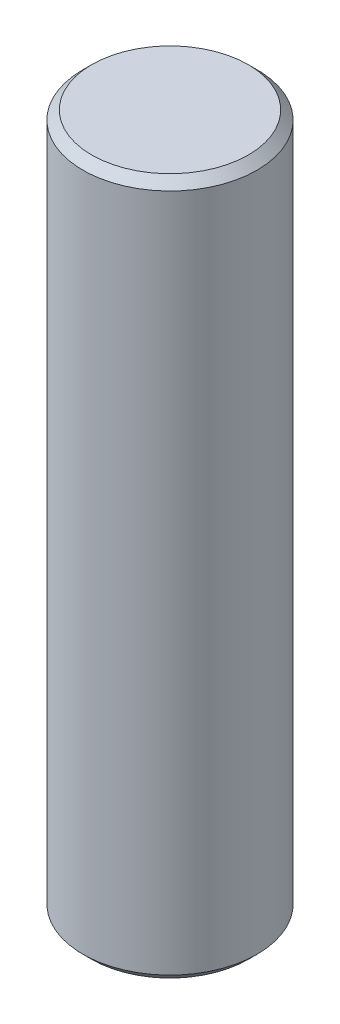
ISO-10303-21;
HEADER;
FILE_DESCRIPTION(('STEP AP214'),'2;1');
FILE_NAME('part.step','',(''),(''),'','','');
FILE_SCHEMA(('AUTOMOTIVE_DESIGN { 1 0 10303 214 1 1 1 1 }'));
ENDSEC;
DATA;
#1=APPLICATION_CONTEXT('core data for automotive mechanical design processes');
#2=APPLICATION_PROTOCOL_DEFINITION('international standard','automotive_design',2000,#1);
#3=PRODUCT_CONTEXT('',#1,'mechanical');
#4=PRODUCT('Part','Part','',(#3));
#5=PRODUCT_RELATED_PRODUCT_CATEGORY('part','',(#4));
#6=PRODUCT_DEFINITION_FORMATION('','',#4);
#7=PRODUCT_DEFINITION_CONTEXT('part definition',#1,'design');
#8=PRODUCT_DEFINITION('design','',#6,#7);
#9=PRODUCT_DEFINITION_SHAPE('','',#8);
#10=(LENGTH_UNIT() NAMED_UNIT(*) SI_UNIT(.MILLI.,.METRE.));
#11=(NAMED_UNIT(*) PLANE_ANGLE_UNIT() SI_UNIT($,.RADIAN.));
#12=(NAMED_UNIT(*) SI_UNIT($,.STERADIAN.) SOLID_ANGLE_UNIT());
#13=UNCERTAINTY_MEASURE_WITH_UNIT(LENGTH_MEASURE(1.E-05),#10,'distance_accuracy_value','');
#14=(GEOMETRIC_REPRESENTATION_CONTEXT(3) GLOBAL_UNCERTAINTY_ASSIGNED_CONTEXT((#13)) GLOBAL_UNIT_ASSIGNED_CONTEXT((#10,
#11,#12)) REPRESENTATION_CONTEXT('',''));
#15=CARTESIAN_POINT('',(0.,0.,0.));
#16=DIRECTION('',(0.,0.,1.));
#17=DIRECTION('',(1.,0.,0.));
#18=AXIS2_PLACEMENT_3D('',#15,#16,#17);
#19=CARTESIAN_POINT('',(0.,127.,0.));
#20=DIRECTION('',(0.,-1.,0.));
#21=DIRECTION('',(1.,0.,0.));
#22=AXIS2_PLACEMENT_3D('',#19,#20,#21);
#23=PLANE('',#22);
#24=CARTESIAN_POINT('',(0.,127.,0.));
#25=DIRECTION('',(0.,-1.,0.));
#26=DIRECTION('',(1.,0.,0.));
#27=AXIS2_PLACEMENT_3D('',#24,#25,#26);
#28=CIRCLE('',#27,14.2748);
#29=CARTESIAN_POINT('',(14.2748,127.,0.));
#30=VERTEX_POINT('',#29);
#31=EDGE_CURVE('E11',#30,#30,#28,.F.);
#32=ORIENTED_EDGE('',*,*,#31,.T.);
#33=EDGE_LOOP('',(#32));
#34=FACE_BOUND('',#33,.T.);
#35=ADVANCED_FACE('F36',(#34),#23,.F.);
#36=CARTESIAN_POINT('',(0.,127.,0.));
#37=DIRECTION('',(0.,1.,0.));
#38=DIRECTION('',(-1.,0.,0.));
#39=AXIS2_PLACEMENT_3D('',#36,#37,#38);
#40=CYLINDRICAL_SURFACE('',#39,15.875);
#41=CARTESIAN_POINT('',(0.,1.6002,0.));
#42=DIRECTION('',(0.,1.,0.));
#43=DIRECTION('',(-1.,0.,0.));
#44=AXIS2_PLACEMENT_3D('',#41,#42,#43);
#45=CIRCLE('',#44,15.875);
#46=CARTESIAN_POINT('',(-15.875,1.6002,0.));
#47=VERTEX_POINT('',#46);
#48=EDGE_CURVE('E59',#47,#47,#45,.T.);
#49=CARTESIAN_POINT('',(0.,125.3998,0.));
#50=DIRECTION('',(0.,-1.,0.));
#51=DIRECTION('',(1.,0.,0.));
#52=AXIS2_PLACEMENT_3D('',#49,#50,#51);
#53=CIRCLE('',#52,15.875);
#54=CARTESIAN_POINT('',(-15.875,125.3998,0.));
#55=VERTEX_POINT('',#54);
#56=EDGE_CURVE('E55',#55,#55,#53,.T.);
#57=CARTESIAN_POINT('',(-15.875,1.6002,0.));
#58=CARTESIAN_POINT('',(-15.875,2.88977916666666,0.));
#59=CARTESIAN_POINT('',(-15.875,4.17935833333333,0.));
#60=CARTESIAN_POINT('',(-15.875,6.75851666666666,0.));
#61=CARTESIAN_POINT('',(-15.875,8.04809583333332,0.));
#62=CARTESIAN_POINT('',(-15.875,10.6272541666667,0.));
#63=CARTESIAN_POINT('',(-15.875,11.9168333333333,0.));
#64=CARTESIAN_POINT('',(-15.875,14.4959916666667,0.));
#65=CARTESIAN_POINT('',(-15.875,15.7855708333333,0.));
#66=CARTESIAN_POINT('',(-15.875,18.3647291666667,0.));
#67=CARTESIAN_POINT('',(-15.875,19.6543083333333,0.));
#68=CARTESIAN_POINT('',(-15.875,22.2334666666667,0.));
#69=CARTESIAN_POINT('',(-15.875,23.5230458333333,0.));
#70=CARTESIAN_POINT('',(-15.875,26.1022041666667,0.));
#71=CARTESIAN_POINT('',(-15.875,27.3917833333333,0.));
#72=CARTESIAN_POINT('',(-15.875,29.9709416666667,0.));
#73=CARTESIAN_POINT('',(-15.875,31.2605208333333,0.));
#74=CARTESIAN_POINT('',(-15.875,33.8396791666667,0.));
#75=CARTESIAN_POINT('',(-15.875,35.1292583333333,0.));
#76=CARTESIAN_POINT('',(-15.875,37.7084166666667,0.));
#77=CARTESIAN_POINT('',(-15.875,38.9979958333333,0.));
#78=CARTESIAN_POINT('',(-15.875,41.5771541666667,0.));
#79=CARTESIAN_POINT('',(-15.875,42.8667333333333,0.));
#80=CARTESIAN_POINT('',(-15.875,45.4458916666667,0.));
#81=CARTESIAN_POINT('',(-15.875,46.7354708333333,0.));
#82=CARTESIAN_POINT('',(-15.875,49.3146291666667,0.));
#83=CARTESIAN_POINT('',(-15.875,50.6042083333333,0.));
#84=CARTESIAN_POINT('',(-15.875,53.1833666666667,0.));
#85=CARTESIAN_POINT('',(-15.875,54.4729458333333,0.));
#86=CARTESIAN_POINT('',(-15.875,57.0521041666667,0.));
#87=CARTESIAN_POINT('',(-15.875,58.3416833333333,0.));
#88=CARTESIAN_POINT('',(-15.875,60.9208416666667,0.));
#89=CARTESIAN_POINT('',(-15.875,62.2104208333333,0.));
#90=CARTESIAN_POINT('',(-15.875,64.7895791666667,0.));
#91=CARTESIAN_POINT('',(-15.875,66.0791583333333,0.));
#92=CARTESIAN_POINT('',(-15.875,68.6583166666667,0.));
#93=CARTESIAN_POINT('',(-15.875,69.9478958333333,0.));
#94=CARTESIAN_POINT('',(-15.875,72.5270541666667,0.));
#95=CARTESIAN_POINT('',(-15.875,73.8166333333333,0.));
#96=CARTESIAN_POINT('',(-15.875,76.3957916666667,0.));
#97=CARTESIAN_POINT('',(-15.875,77.6853708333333,0.));
#98=CARTESIAN_POINT('',(-15.875,80.2645291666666,0.));
#99=CARTESIAN_POINT('',(-15.875,81.5541083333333,0.));
#100=CARTESIAN_POINT('',(-15.875,84.1332666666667,0.));
#101=CARTESIAN_POINT('',(-15.875,85.4228458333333,0.));
#102=CARTESIAN_POINT('',(-15.875,88.0020041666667,0.));
#103=CARTESIAN_POINT('',(-15.875,89.2915833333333,0.));
#104=CARTESIAN_POINT('',(-15.875,91.8707416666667,0.));
#105=CARTESIAN_POINT('',(-15.875,93.1603208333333,0.));
#106=CARTESIAN_POINT('',(-15.875,95.7394791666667,0.));
#107=CARTESIAN_POINT('',(-15.875,97.0290583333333,0.));
#108=CARTESIAN_POINT('',(-15.875,99.6082166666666,0.));
#109=CARTESIAN_POINT('',(-15.875,100.897795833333,0.));
#110=CARTESIAN_POINT('',(-15.875,103.476954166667,0.));
#111=CARTESIAN_POINT('',(-15.875,104.766533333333,0.));
#112=CARTESIAN_POINT('',(-15.875,107.345691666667,0.));
#113=CARTESIAN_POINT('',(-15.875,108.635270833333,0.));
#114=CARTESIAN_POINT('',(-15.875,111.214429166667,0.));
#115=CARTESIAN_POINT('',(-15.875,112.504008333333,0.));
#116=CARTESIAN_POINT('',(-15.875,115.083166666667,0.));
#117=CARTESIAN_POINT('',(-15.875,116.372745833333,0.));
#118=CARTESIAN_POINT('',(-15.875,118.951904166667,0.));
#119=CARTESIAN_POINT('',(-15.875,120.241483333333,0.));
#120=CARTESIAN_POINT('',(-15.875,122.820641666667,0.));
#121=CARTESIAN_POINT('',(-15.875,124.110220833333,0.));
#122=CARTESIAN_POINT('',(-15.875,125.3998,0.));
#123=B_SPLINE_CURVE_WITH_KNOTS('',3,(#57,#58,#59,#60,#61,#62,#63,#64,#65,#66,#67,#68,#69,#70,
#71,#72,#73,#74,#75,#76,#77,#78,#79,#80,#81,#82,#83,#84,#85,#86,#87,#88,#89,#90,#91,#92,#93,#94,
#95,#96,#97,#98,#99,#100,#101,#102,#103,#104,#105,#106,#107,#108,#109,#110,#111,#112,#113,#114,
#115,#116,#117,#118,#119,#120,#121,#122),.UNSPECIFIED.,.F.,.F.,(4,2,2,2,2,2,2,2,2,2,2,2,2,2,2,2,
2,2,2,2,2,2,2,2,2,2,2,2,2,2,2,2,4),(0.,3.8687375,7.73747499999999,11.6062125,15.47495,
19.3436875,23.212425,27.0811625,30.9499,34.8186375,38.687375,42.5561125,46.42485,50.2935875,
54.162325,58.0310625,61.8998,65.7685375,69.637275,73.5060125,77.37475,81.2434875,85.112225,
88.9809625,92.8497,96.7184375,100.587175,104.4559125,108.32465,112.1933875,116.062125,
119.9308625,123.7996),.UNSPECIFIED.);
#124=EDGE_CURVE('BSEAM75',#47,#55,#123,.T.);
#125=ORIENTED_EDGE('',*,*,#48,.T.);
#126=ORIENTED_EDGE('',*,*,#56,.T.);
#127=ORIENTED_EDGE('',*,*,#124,.T.);
#128=ORIENTED_EDGE('',*,*,#124,.F.);
#129=EDGE_LOOP('',(#125,#127,#126,#128));
#130=FACE_BOUND('',#129,.T.);
#131=ADVANCED_FACE('F75',(#130),#40,.T.);
#132=CARTESIAN_POINT('',(0.,0.,0.));
#133=DIRECTION('',(0.,1.,0.));
#134=DIRECTION('',(-1.,0.,0.));
#135=AXIS2_PLACEMENT_3D('',#132,#133,#134);
#136=PLANE('',#135);
#137=CARTESIAN_POINT('',(0.,0.,0.));
#138=DIRECTION('',(0.,-1.,0.));
#139=DIRECTION('',(0.,0.,-1.));
#140=AXIS2_PLACEMENT_3D('',#137,#138,#139);
#141=CIRCLE('',#140,3.96874999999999);
#142=CARTESIAN_POINT('',(0.,0.,-3.96874999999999));
#143=VERTEX_POINT('',#142);
#144=EDGE_CURVE('E56',#143,#143,#141,.T.);
#145=ORIENTED_EDGE('',*,*,#144,.F.);
#146=EDGE_LOOP('',(#145));
#147=FACE_BOUND('',#146,.T.);
#148=CARTESIAN_POINT('',(0.,0.,0.));
#149=DIRECTION('',(0.,1.,0.));
#150=DIRECTION('',(-1.,0.,0.));
#151=AXIS2_PLACEMENT_3D('',#148,#149,#150);
#152=CIRCLE('',#151,14.2748);
#153=CARTESIAN_POINT('',(-14.2748,0.,0.));
#154=VERTEX_POINT('',#153);
#155=EDGE_CURVE('E43',#154,#154,#152,.F.);
#156=ORIENTED_EDGE('',*,*,#155,.T.);
#157=EDGE_LOOP('',(#156));
#158=FACE_BOUND('',#157,.T.);
#159=ADVANCED_FACE('F68',(#147,#158),#136,.F.);
#160=CARTESIAN_POINT('',(0.,1.6002,0.));
#161=DIRECTION('',(0.,1.,0.));
#162=DIRECTION('',(-1.,0.,0.));
#163=AXIS2_PLACEMENT_3D('',#160,#161,#162);
#164=CONICAL_SURFACE('',#163,15.875,0.785398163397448);
#165=CARTESIAN_POINT('',(-14.2748,0.,0.));
#166=CARTESIAN_POINT('',(-14.29146875,0.0166687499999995,0.));
#167=CARTESIAN_POINT('',(-14.3081375,0.0333374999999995,0.));
#168=CARTESIAN_POINT('',(-14.341475,0.0666749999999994,0.));
#169=CARTESIAN_POINT('',(-14.35814375,0.0833437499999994,0.));
#170=CARTESIAN_POINT('',(-14.39148125,0.116681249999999,0.));
#171=CARTESIAN_POINT('',(-14.40815,0.133349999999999,0.));
#172=CARTESIAN_POINT('',(-14.4414875,0.166687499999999,0.));
#173=CARTESIAN_POINT('',(-14.45815625,0.183356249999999,0.));
#174=CARTESIAN_POINT('',(-14.49149375,0.216693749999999,0.));
#175=CARTESIAN_POINT('',(-14.5081625,0.233362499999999,0.));
#176=CARTESIAN_POINT('',(-14.5415,0.266699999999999,0.));
#177=CARTESIAN_POINT('',(-14.55816875,0.283368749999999,0.));
#178=CARTESIAN_POINT('',(-14.59150625,0.316706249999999,0.));
#179=CARTESIAN_POINT('',(-14.608175,0.333374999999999,0.));
#180=CARTESIAN_POINT('',(-14.6415125,0.366712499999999,0.));
#181=CARTESIAN_POINT('',(-14.65818125,0.383381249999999,0.));
#182=CARTESIAN_POINT('',(-14.69151875,0.416718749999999,0.));
#183=CARTESIAN_POINT('',(-14.7081875,0.433387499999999,0.));
#184=CARTESIAN_POINT('',(-14.741525,0.466724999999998,0.));
#185=CARTESIAN_POINT('',(-14.75819375,0.483393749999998,0.));
#186=CARTESIAN_POINT('',(-14.79153125,0.516731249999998,0.));
#187=CARTESIAN_POINT('',(-14.8082,0.533399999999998,0.));
#188=CARTESIAN_POINT('',(-14.8415375,0.566737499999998,0.));
#189=CARTESIAN_POINT('',(-14.85820625,0.583406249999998,0.));
#190=CARTESIAN_POINT('',(-14.89154375,0.616743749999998,0.));
#191=CARTESIAN_POINT('',(-14.9082125,0.633412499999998,0.));
#192=CARTESIAN_POINT('',(-14.94155,0.666749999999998,0.));
#193=CARTESIAN_POINT('',(-14.95821875,0.683418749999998,0.));
#194=CARTESIAN_POINT('',(-14.99155625,0.716756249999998,0.));
#195=CARTESIAN_POINT('',(-15.008225,0.733424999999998,0.));
#196=CARTESIAN_POINT('',(-15.0415625,0.766762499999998,0.));
#197=CARTESIAN_POINT('',(-15.05823125,0.783431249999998,0.));
#198=CARTESIAN_POINT('',(-15.09156875,0.816768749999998,0.));
#199=CARTESIAN_POINT('',(-15.1082375,0.833437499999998,0.));
#200=CARTESIAN_POINT('',(-15.141575,0.866774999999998,0.));
#201=CARTESIAN_POINT('',(-15.15824375,0.883443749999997,0.));
#202=CARTESIAN_POINT('',(-15.19158125,0.916781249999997,0.));
#203=CARTESIAN_POINT('',(-15.20825,0.933449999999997,0.));
#204=CARTESIAN_POINT('',(-15.2415875,0.966787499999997,0.));
#205=CARTESIAN_POINT('',(-15.25825625,0.983456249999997,0.));
#206=CARTESIAN_POINT('',(-15.29159375,1.01679375,0.));
#207=CARTESIAN_POINT('',(-15.3082625,1.0334625,0.));
#208=CARTESIAN_POINT('',(-15.3416,1.0668,0.));
#209=CARTESIAN_POINT('',(-15.35826875,1.08346875,0.));
#210=CARTESIAN_POINT('',(-15.39160625,1.11680625,0.));
#211=CARTESIAN_POINT('',(-15.408275,1.133475,0.));
#212=CARTESIAN_POINT('',(-15.4416125,1.1668125,0.));
#213=CARTESIAN_POINT('',(-15.45828125,1.18348125,0.));
#214=CARTESIAN_POINT('',(-15.49161875,1.21681875,0.));
#215=CARTESIAN_POINT('',(-15.5082875,1.2334875,0.));
#216=CARTESIAN_POINT('',(-15.541625,1.266825,0.));
#217=CARTESIAN_POINT('',(-15.55829375,1.28349375,0.));
#218=CARTESIAN_POINT('',(-15.59163125,1.31683125,0.));
#219=CARTESIAN_POINT('',(-15.6083,1.3335,0.));
#220=CARTESIAN_POINT('',(-15.6416375,1.3668375,0.));
#221=CARTESIAN_POINT('',(-15.65830625,1.38350625,0.));
#222=CARTESIAN_POINT('',(-15.69164375,1.41684375,0.));
#223=CARTESIAN_POINT('',(-15.7083125,1.4335125,0.));
#224=CARTESIAN_POINT('',(-15.74165,1.46685,0.));
#225=CARTESIAN_POINT('',(-15.75831875,1.48351875,0.));
#226=CARTESIAN_POINT('',(-15.79165625,1.51685625,0.));
#227=CARTESIAN_POINT('',(-15.808325,1.533525,0.));
#228=CARTESIAN_POINT('',(-15.8416625,1.5668625,0.));
#229=CARTESIAN_POINT('',(-15.85833125,1.58353125,0.));
#230=CARTESIAN_POINT('',(-15.875,1.6002,0.));
#231=B_SPLINE_CURVE_WITH_KNOTS('',3,(#165,#166,#167,#168,#169,#170,#171,#172,#173,#174,#175,
#176,#177,#178,#179,#180,#181,#182,#183,#184,#185,#186,#187,#188,#189,#190,#191,#192,#193,#194,
#195,#196,#197,#198,#199,#200,#201,#202,#203,#204,#205,#206,#207,#208,#209,#210,#211,#212,#213,
#214,#215,#216,#217,#218,#219,#220,#221,#222,#223,#224,#225,#226,#227,#228,#229,#230),
.UNSPECIFIED.,.F.,.F.,(4,2,2,2,2,2,2,2,2,2,2,2,2,2,2,2,2,2,2,2,2,2,2,2,2,2,2,2,2,2,2,2,4),(0.,
0.0707195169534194,0.141439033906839,0.212158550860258,0.282878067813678,0.353597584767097,
0.424317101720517,0.495036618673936,0.565756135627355,0.636475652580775,0.707195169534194,
0.777914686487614,0.848634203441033,0.919353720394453,0.990073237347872,1.06079275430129,
1.13151227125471,1.20223178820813,1.27295130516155,1.34367082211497,1.41439033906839,
1.48510985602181,1.55582937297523,1.62654888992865,1.69726840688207,1.76798792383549,
1.83870744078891,1.90942695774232,1.98014647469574,2.05086599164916,2.12158550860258,
2.192305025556,2.26302454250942),.UNSPECIFIED.);
#232=EDGE_CURVE('BSEAM70',#154,#47,#231,.T.);
#233=ORIENTED_EDGE('',*,*,#155,.F.);
#234=ORIENTED_EDGE('',*,*,#48,.F.);
#235=ORIENTED_EDGE('',*,*,#232,.T.);
#236=ORIENTED_EDGE('',*,*,#232,.F.);
#237=EDGE_LOOP('',(#233,#235,#234,#236));
#238=FACE_BOUND('',#237,.T.);
#239=ADVANCED_FACE('F70',(#238),#164,.T.);
#240=CARTESIAN_POINT('',(0.,127.,0.));
#241=DIRECTION('',(0.,-1.,0.));
#242=DIRECTION('',(1.,0.,0.));
#243=AXIS2_PLACEMENT_3D('',#240,#241,#242);
#244=CONICAL_SURFACE('',#243,14.2748,0.785398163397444);
#245=ORIENTED_EDGE('',*,*,#56,.F.);
#246=EDGE_LOOP('',(#245));
#247=FACE_BOUND('',#246,.T.);
#248=ORIENTED_EDGE('',*,*,#31,.F.);
#249=EDGE_LOOP('',(#248));
#250=FACE_BOUND('',#249,.T.);
#251=ADVANCED_FACE('F38',(#247,#250),#244,.T.);
#252=CARTESIAN_POINT('',(0.,20.6375,0.));
#253=DIRECTION('',(0.,-1.,0.));
#254=DIRECTION('',(0.,0.,-1.));
#255=AXIS2_PLACEMENT_3D('',#252,#253,#254);
#256=CONICAL_SURFACE('',#255,3.96874999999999,1.02974425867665);
#257=CARTESIAN_POINT('',(0.,23.0221655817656,0.));
#258=VERTEX_POINT('',#257);
#259=VERTEX_LOOP('',#258);
#260=FACE_BOUND('',#259,.T.);
#261=CARTESIAN_POINT('',(0.,20.6375,0.));
#262=DIRECTION('',(0.,-1.,0.));
#263=DIRECTION('',(0.,0.,-1.));
#264=AXIS2_PLACEMENT_3D('',#261,#262,#263);
#265=CIRCLE('',#264,3.96874999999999);
#266=CARTESIAN_POINT('',(0.,20.6375,-3.96874999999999));
#267=VERTEX_POINT('',#266);
#268=EDGE_CURVE('E53',#267,#267,#265,.T.);
#269=ORIENTED_EDGE('',*,*,#268,.T.);
#270=EDGE_LOOP('',(#269));
#271=FACE_BOUND('',#270,.T.);
#272=ADVANCED_FACE('F46',(#260,#271),#256,.F.);
#273=CARTESIAN_POINT('',(0.,0.,0.));
#274=DIRECTION('',(0.,-1.,0.));
#275=DIRECTION('',(0.,0.,-1.));
#276=AXIS2_PLACEMENT_3D('',#273,#274,#275);
#277=CYLINDRICAL_SURFACE('',#276,3.96874999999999);
#278=ORIENTED_EDGE('',*,*,#268,.F.);
#279=EDGE_LOOP('',(#278));
#280=FACE_BOUND('',#279,.T.);
#281=ORIENTED_EDGE('',*,*,#144,.T.);
#282=EDGE_LOOP('',(#281));
#283=FACE_BOUND('',#282,.T.);
#284=ADVANCED_FACE('F49',(#280,#283),#277,.F.);
#285=CLOSED_SHELL('',(#35,#131,#159,#239,#251,#272,#284));
#286=MANIFOLD_SOLID_BREP('B2',#285);
#287=ADVANCED_BREP_SHAPE_REPRESENTATION('',(#18,#286),#14);
#288=SHAPE_DEFINITION_REPRESENTATION(#9,#287);
ENDSEC;
END-ISO-10303-21;
